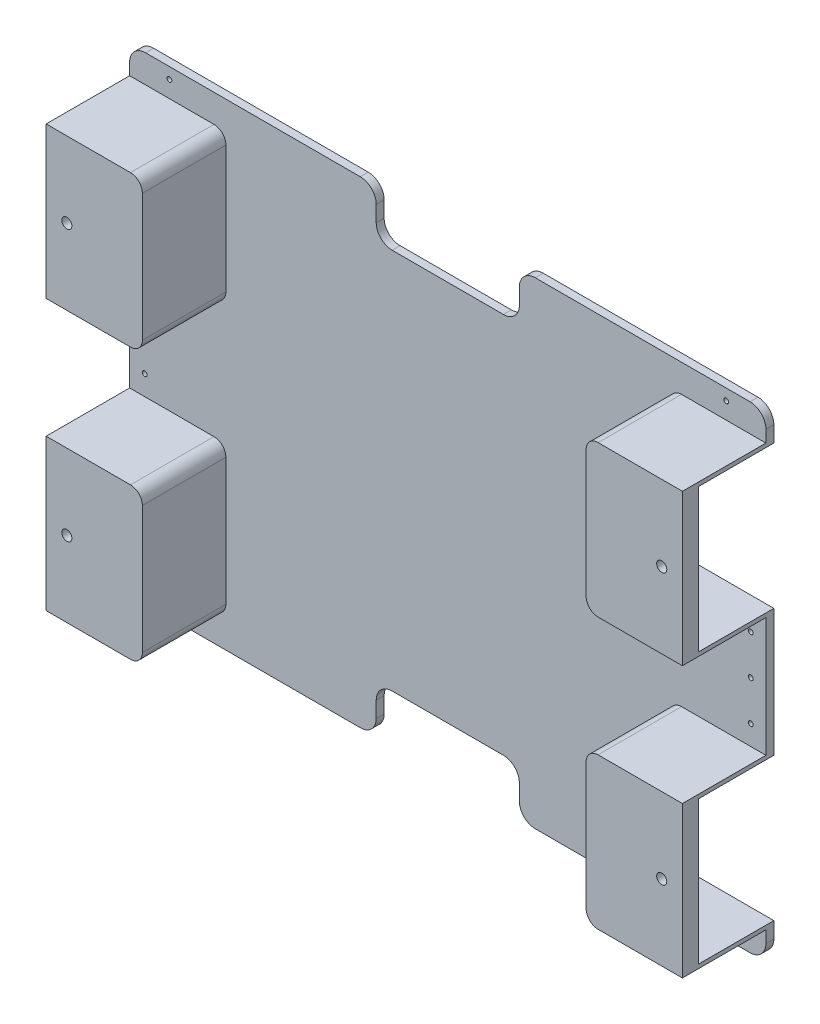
from build123d import *

# Parameters (mm, degrees)
BOSS_EXTRU_1_DEPTH      = 10
CONG_1_R                = 20
ESQUISSE3_R             = 3
ENL_V_MAT_EXTRU_1_DEPTH = 855.458893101
ESQUISSE4_W             = 116
ESQUISSE4_H             = 180
ENL_V_MAT_EXTRU_2_DEPTH = 855.458893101
CONG_2_R                = 10
BOSS_EXTRU_2_DEPTH      = 85
BOSS_EXTRU_3_DEPTH      = 20
ENL_V_MAT_EXTRU_3_REACH = 864.105
ESQUISSE7_R             = 6.35
ESQUISSE8_R             = 3
ENL_V_MAT_EXTRU_4_DEPTH = 861.82808969


with BuildPart() as part:
    # Esquisse2 → Boss.-Extru.1 (new body)
    with BuildSketch(Plane.XY):
        Polygon((-800, 300), (-490, 300), (-490, 240), (-310, 240), (-310, 300), (0, 300), (0, -300), (-310, -300), (-310, -240), (-490, -240), (-490, -300), (-800, -300), align=None)
    extrude(amount=BOSS_EXTRU_1_DEPTH)

    # Cong_1
    cong_1_edges = [part.edges().sort_by_distance(p)[0] for p in [
        (-800, 300, 5),
        (-490, 300, 5),
        (-490, 240, 5),
        (-310, 240, 5),
        (-310, 300, 5),
        (0, 300, 5),
        (0, -300, 5),
        (-310, -300, 5),
        (-310, -240, 5),
        (-490, -240, 5),
        (-490, -300, 5),
        (-800, -300, 5),
    ]]
    fillet(cong_1_edges, radius=CONG_1_R)

    # Esquisse3 → Enl_v. mat.-Extru.1 (cut, through all)
    with BuildSketch(Plane.XY.offset(10)):
        with Locations((-750, 286)):
            Circle(ESQUISSE3_R)
        with Locations((-50, 286)):
            Circle(ESQUISSE3_R)
        with Locations((-750, -286)):
            Circle(ESQUISSE3_R)
        with Locations((-50, -286)):
            Circle(ESQUISSE3_R)
    extrude(amount=-ENL_V_MAT_EXTRU_1_DEPTH, mode=Mode.SUBTRACT)

    # Esquisse4 → Enl_v. mat.-Extru.2 (cut, through all)
    with BuildSketch(Plane.XY.offset(10)):
        with Locations((-58, 170)):
            Rectangle(ESQUISSE4_W, ESQUISSE4_H)
        with Locations((-742, 170)):
            Rectangle(ESQUISSE4_W, ESQUISSE4_H)
        with Locations((-742, -170)):
            Rectangle(ESQUISSE4_W, ESQUISSE4_H)
        with Locations((-58, -170)):
            Rectangle(ESQUISSE4_W, ESQUISSE4_H)
    extrude(amount=-ENL_V_MAT_EXTRU_2_DEPTH, mode=Mode.SUBTRACT)

    # Cong_2
    cong_2_edges = [part.edges().sort_by_distance(p)[0] for p in [
        (-116, -80, 5),
        (-116, -260, 5),
        (-684, -80, 5),
        (-684, -260, 5),
        (-684, 80, 5),
        (-684, 260, 5),
        (-116, 80, 5),
        (-116, 260, 5),
    ]]
    fillet(cong_2_edges, radius=CONG_2_R)

    # Esquisse5 → Boss.-Extru.2 (add)
    with BuildSketch(Plane.XY.offset(10)):
        with BuildLine():
            Line((-800, 265), (-694, 265))
            ThreePointArc((-694, 265), (-683.393398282, 260.606601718), (-679, 250))
            Line((-679, 250), (-679, 90))
            ThreePointArc((-679, 90), (-683.393398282, 79.393398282), (-694, 75))
            Line((-694, 75), (-800, 75))
            Line((-800, 75), (-800, 80))
            Line((-800, 80), (-694, 80))
            ThreePointArc((-694, 80), (-686.928932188, 82.928932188), (-684, 90))
            Line((-684, 90), (-684, 250))
            ThreePointArc((-684, 250), (-686.928932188, 257.071067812), (-694, 260))
            Line((-694, 260), (-800, 260))
            Line((-800, 260), (-800, 265))
        make_face()
        with BuildLine():
            Line((0, 75), (-106, 75))
            ThreePointArc((-106, 75), (-116.606601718, 79.393398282), (-121, 90))
            Line((-121, 90), (-121, 250))
            ThreePointArc((-121, 250), (-116.606601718, 260.606601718), (-106, 265))
            Line((-106, 265), (0, 265))
            Line((0, 265), (0, 260))
            Line((0, 260), (-106, 260))
            ThreePointArc((-106, 260), (-113.071067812, 257.071067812), (-116, 250))
            Line((-116, 250), (-116, 90))
            ThreePointArc((-116, 90), (-113.071067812, 82.928932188), (-106, 80))
            Line((-106, 80), (0, 80))
            Line((0, 80), (0, 75))
        make_face()
        with BuildLine():
            Line((0, -265), (-106, -265))
            ThreePointArc((-106, -265), (-116.606601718, -260.606601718), (-121, -250))
            Line((-121, -250), (-121, -90))
            ThreePointArc((-121, -90), (-116.606601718, -79.393398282), (-106, -75))
            Line((-106, -75), (0, -75))
            Line((0, -75), (0, -80))
            Line((0, -80), (-106, -80))
            ThreePointArc((-106, -80), (-113.071067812, -82.928932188), (-116, -90))
            Line((-116, -90), (-116, -250))
            ThreePointArc((-116, -250), (-113.071067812, -257.071067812), (-106, -260))
            Line((-106, -260), (0, -260))
            Line((0, -260), (0, -265))
        make_face()
        with BuildLine():
            Line((-800, -75), (-694, -75))
            ThreePointArc((-694, -75), (-683.393398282, -79.393398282), (-679, -90))
            Line((-679, -90), (-679, -250))
            ThreePointArc((-679, -250), (-683.393398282, -260.606601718), (-694, -265))
            Line((-694, -265), (-800, -265))
            Line((-800, -265), (-800, -260))
            Line((-800, -260), (-694, -260))
            ThreePointArc((-694, -260), (-686.928932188, -257.071067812), (-684, -250))
            Line((-684, -250), (-684, -90))
            ThreePointArc((-684, -90), (-686.928932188, -82.928932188), (-694, -80))
            Line((-694, -80), (-800, -80))
            Line((-800, -80), (-800, -75))
        make_face()
    extrude(amount=BOSS_EXTRU_2_DEPTH)

    # Esquisse6 → Boss.-Extru.3 (add)
    with BuildSketch(Plane.XY.offset(95)):
        with BuildLine():
            Line((-694, 265), (-800, 265))
            Line((-800, 265), (-800, 260))
            Line((-800, 260), (-694, 260))
            ThreePointArc((-694, 260), (-686.928932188, 257.071067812), (-684, 250))
            Line((-684, 250), (-684, 90))
            ThreePointArc((-684, 90), (-686.928932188, 82.928932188), (-694, 80))
            Line((-694, 80), (-800, 80))
            Line((-800, 80), (-800, 75))
            Line((-800, 75), (-694, 75))
            ThreePointArc((-694, 75), (-683.393398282, 79.393398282), (-679, 90))
            Line((-679, 90), (-679, 250))
            ThreePointArc((-679, 250), (-683.393398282, 260.606601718), (-694, 265))
        make_face()
        with BuildLine():
            Line((-694, 260), (-800, 260))
            Line((-800, 260), (-800, 80))
            Line((-800, 80), (-694, 80))
            ThreePointArc((-694, 80), (-686.928932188, 82.928932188), (-684, 90))
            Line((-684, 90), (-684, 250))
            ThreePointArc((-684, 250), (-686.928932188, 257.071067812), (-694, 260))
        make_face()
        with BuildLine():
            Line((-679, -250), (-679, -90))
            ThreePointArc((-679, -90), (-683.393398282, -79.393398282), (-694, -75))
            Line((-694, -75), (-800, -75))
            Line((-800, -75), (-800, -80))
            Line((-800, -80), (-800, -260))
            Line((-800, -260), (-800, -265))
            Line((-800, -265), (-694, -265))
            ThreePointArc((-694, -265), (-683.393398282, -260.606601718), (-679, -250))
        make_face()
        with BuildLine():
            Line((-121, -90), (-121, -250))
            ThreePointArc((-121, -250), (-116.606601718, -260.606601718), (-106, -265))
            Line((-106, -265), (0, -265))
            Line((0, -265), (0, -260))
            Line((0, -260), (0, -80))
            Line((0, -80), (0, -75))
            Line((0, -75), (-106, -75))
            ThreePointArc((-106, -75), (-116.606601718, -79.393398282), (-121, -90))
        make_face()
        with BuildLine():
            Line((-121, 250), (-121, 90))
            ThreePointArc((-121, 90), (-116.606601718, 79.393398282), (-106, 75))
            Line((-106, 75), (0, 75))
            Line((0, 75), (0, 80))
            Line((0, 80), (0, 260))
            Line((0, 260), (0, 265))
            Line((0, 265), (-106, 265))
            ThreePointArc((-106, 265), (-116.606601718, 260.606601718), (-121, 250))
        make_face()
    extrude(amount=BOSS_EXTRU_3_DEPTH)

    # Esquisse7 → Enl_v. mat.-Extru.3 (cut, up to next)
    with BuildSketch(Plane.XY.offset(115), mode=Mode.PRIVATE) as enl_v_mat_extru_3_sk1:
        with Locations((-774, 170)):
            Circle(ESQUISSE7_R)
    enl_v_mat_extru_3_tool1 = extrude(enl_v_mat_extru_3_sk1.sketch, amount=-ENL_V_MAT_EXTRU_3_REACH, mode=Mode.PRIVATE) & part.part
    # Esquisse7 → Enl_v. mat.-Extru.3 (cut, up to next)
    with BuildSketch(Plane.XY.offset(115), mode=Mode.PRIVATE) as enl_v_mat_extru_3_sk2:
        with Locations((-26, 170)):
            Circle(ESQUISSE7_R)
    enl_v_mat_extru_3_tool2 = extrude(enl_v_mat_extru_3_sk2.sketch, amount=-ENL_V_MAT_EXTRU_3_REACH, mode=Mode.PRIVATE) & part.part
    # Esquisse7 → Enl_v. mat.-Extru.3 (cut, up to next)
    with BuildSketch(Plane.XY.offset(115), mode=Mode.PRIVATE) as enl_v_mat_extru_3_sk3:
        with Locations((-774, -170)):
            Circle(ESQUISSE7_R)
    enl_v_mat_extru_3_tool3 = extrude(enl_v_mat_extru_3_sk3.sketch, amount=-ENL_V_MAT_EXTRU_3_REACH, mode=Mode.PRIVATE) & part.part
    # Esquisse7 → Enl_v. mat.-Extru.3 (cut, up to next)
    with BuildSketch(Plane.XY.offset(115), mode=Mode.PRIVATE) as enl_v_mat_extru_3_sk4:
        with Locations((-26, -170)):
            Circle(ESQUISSE7_R)
    enl_v_mat_extru_3_tool4 = extrude(enl_v_mat_extru_3_sk4.sketch, amount=-ENL_V_MAT_EXTRU_3_REACH, mode=Mode.PRIVATE) & part.part
    add(enl_v_mat_extru_3_tool1.solids().sort_by_distance((-774, 170, 115))[0], mode=Mode.SUBTRACT)
    add(enl_v_mat_extru_3_tool2.solids().sort_by_distance((-26, 170, 115))[0], mode=Mode.SUBTRACT)
    add(enl_v_mat_extru_3_tool3.solids().sort_by_distance((-774, -170, 115))[0], mode=Mode.SUBTRACT)
    add(enl_v_mat_extru_3_tool4.solids().sort_by_distance((-26, -170, 115))[0], mode=Mode.SUBTRACT)

    # Esquisse8 → Enl_v. mat.-Extru.4 (cut, through all)
    with BuildSketch(Plane.XY.offset(10)):
        with Locations((-781, 50)):
            Circle(ESQUISSE8_R)
        with Locations((-781, 0)):
            Circle(ESQUISSE8_R)
        with Locations((-781, -50)):
            Circle(ESQUISSE8_R)
        with Locations(Location((-19, -50, 0), (0, 0, 180))):
            Circle(ESQUISSE8_R)
        with Locations(Location((-19, 0, 0), (0, 0, 180))):
            Circle(ESQUISSE8_R)
        with Locations(Location((-19, 50, 0), (0, 0, 180))):
            Circle(ESQUISSE8_R)
    extrude(amount=-ENL_V_MAT_EXTRU_4_DEPTH, mode=Mode.SUBTRACT)


solid = part.part
